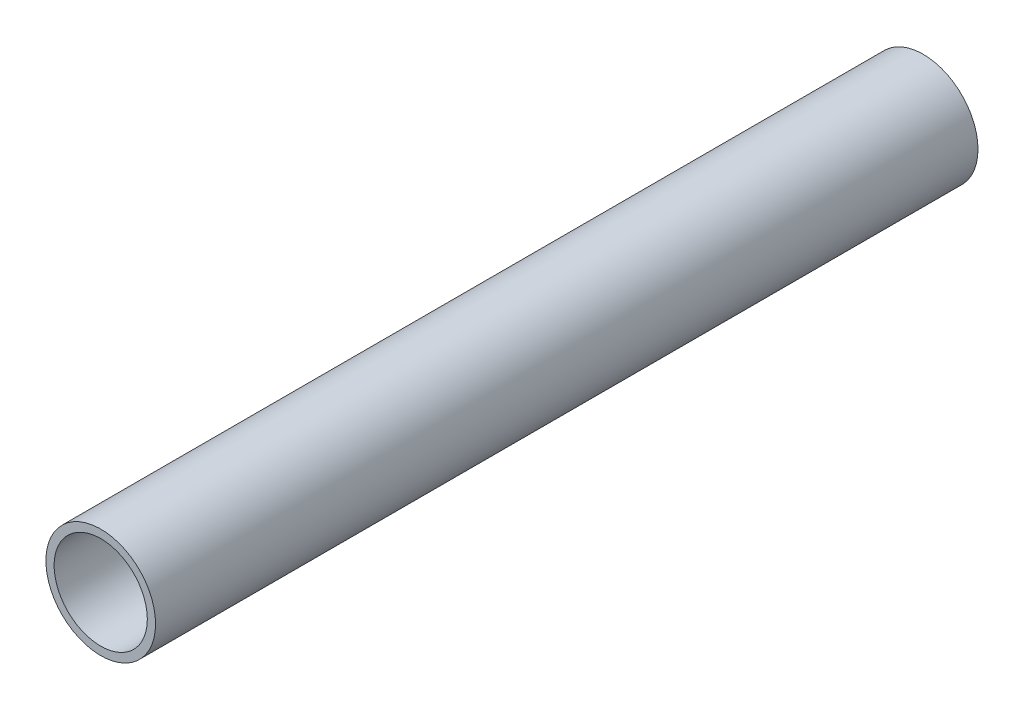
from build123d import *

# Parameters (mm, degrees)
ESQUISSE1_R      = 10
ESQUISSE1_R_2    = 8.5
EXTRUSION1_DEPTH = 150


with BuildPart() as part:
    # Esquisse1 → Extrusion1 (new body)
    with BuildSketch(Plane.XY):
        Circle(ESQUISSE1_R)
        Circle(ESQUISSE1_R_2, mode=Mode.SUBTRACT)
    extrude(amount=EXTRUSION1_DEPTH)


solid = part.part
